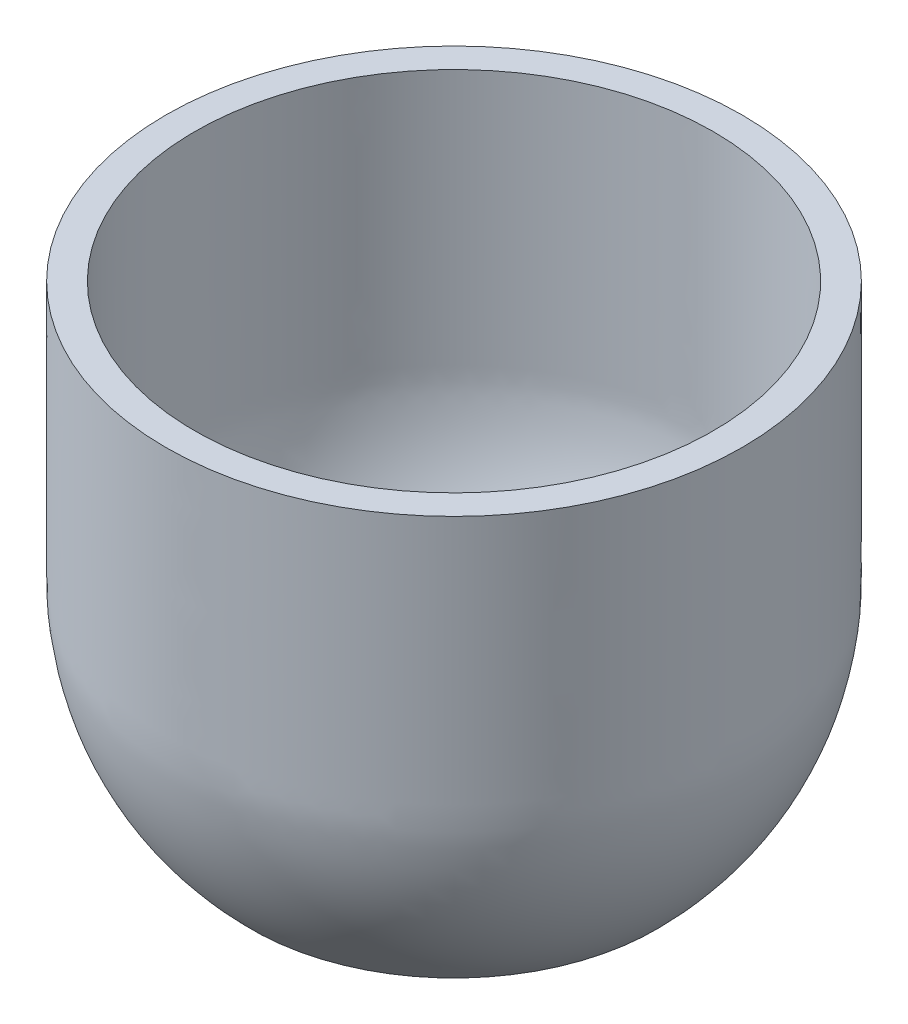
ISO-10303-21;
HEADER;
FILE_DESCRIPTION(('STEP AP214'),'2;1');
FILE_NAME('part.step','',(''),(''),'','','');
FILE_SCHEMA(('AUTOMOTIVE_DESIGN { 1 0 10303 214 1 1 1 1 }'));
ENDSEC;
DATA;
#1=APPLICATION_CONTEXT('core data for automotive mechanical design processes');
#2=APPLICATION_PROTOCOL_DEFINITION('international standard','automotive_design',2000,#1);
#3=PRODUCT_CONTEXT('',#1,'mechanical');
#4=PRODUCT('Part','Part','',(#3));
#5=PRODUCT_RELATED_PRODUCT_CATEGORY('part','',(#4));
#6=PRODUCT_DEFINITION_FORMATION('','',#4);
#7=PRODUCT_DEFINITION_CONTEXT('part definition',#1,'design');
#8=PRODUCT_DEFINITION('design','',#6,#7);
#9=PRODUCT_DEFINITION_SHAPE('','',#8);
#10=(LENGTH_UNIT() NAMED_UNIT(*) SI_UNIT(.MILLI.,.METRE.));
#11=(NAMED_UNIT(*) PLANE_ANGLE_UNIT() SI_UNIT($,.RADIAN.));
#12=(NAMED_UNIT(*) SI_UNIT($,.STERADIAN.) SOLID_ANGLE_UNIT());
#13=UNCERTAINTY_MEASURE_WITH_UNIT(LENGTH_MEASURE(1.E-05),#10,'distance_accuracy_value','');
#14=(GEOMETRIC_REPRESENTATION_CONTEXT(3) GLOBAL_UNCERTAINTY_ASSIGNED_CONTEXT((#13)) GLOBAL_UNIT_ASSIGNED_CONTEXT((#10,
#11,#12)) REPRESENTATION_CONTEXT('',''));
#15=CARTESIAN_POINT('',(0.,0.,0.));
#16=DIRECTION('',(0.,0.,1.));
#17=DIRECTION('',(1.,0.,0.));
#18=AXIS2_PLACEMENT_3D('',#15,#16,#17);
#19=CARTESIAN_POINT('',(0.,5.00000000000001,0.));
#20=DIRECTION('',(0.,1.,0.));
#21=DIRECTION('',(0.,0.,1.));
#22=AXIS2_PLACEMENT_3D('',#19,#20,#21);
#23=PLANE('',#22);
#24=CARTESIAN_POINT('',(0.,5.00000000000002,0.));
#25=DIRECTION('',(0.,-1.,0.));
#26=DIRECTION('',(0.,0.,-1.));
#27=AXIS2_PLACEMENT_3D('',#24,#25,#26);
#28=CIRCLE('',#27,32.8948540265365);
#29=CARTESIAN_POINT('',(0.,5.00000000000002,-32.8948540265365));
#30=VERTEX_POINT('',#29);
#31=EDGE_CURVE('E44',#30,#30,#28,.T.);
#32=ORIENTED_EDGE('',*,*,#31,.F.);
#33=EDGE_LOOP('',(#32));
#34=FACE_BOUND('',#33,.T.);
#35=ADVANCED_FACE('F30',(#34),#23,.T.);
#36=CARTESIAN_POINT('',(0.,0.,0.));
#37=DIRECTION('',(0.,1.,0.));
#38=DIRECTION('',(0.,0.,1.));
#39=AXIS2_PLACEMENT_3D('',#36,#37,#38);
#40=PLANE('',#39);
#41=CARTESIAN_POINT('',(0.,0.,0.));
#42=DIRECTION('',(0.,-1.,0.));
#43=DIRECTION('',(0.,0.,-1.));
#44=AXIS2_PLACEMENT_3D('',#41,#42,#43);
#45=CIRCLE('',#44,35.);
#46=CARTESIAN_POINT('',(0.,0.,-35.));
#47=VERTEX_POINT('',#46);
#48=EDGE_CURVE('E10',#47,#47,#45,.T.);
#49=ORIENTED_EDGE('',*,*,#48,.T.);
#50=EDGE_LOOP('',(#49));
#51=FACE_BOUND('',#50,.T.);
#52=ADVANCED_FACE('F70',(#51),#40,.F.);
#53=CARTESIAN_POINT('',(50.,80.,0.));
#54=CARTESIAN_POINT('',(50.,68.9267855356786,0.));
#55=CARTESIAN_POINT('',(50.,57.8535710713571,0.));
#56=CARTESIAN_POINT('',(50.,46.7803566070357,0.));
#57=CARTESIAN_POINT('',(50.,45.5499994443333,0.));
#58=CARTESIAN_POINT('',(50.,43.0892851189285,0.));
#59=CARTESIAN_POINT('',(50.,39.3982136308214,0.));
#60=CARTESIAN_POINT('',(50.,36.9374993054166,0.));
#61=CARTESIAN_POINT('',(50.,35.7071421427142,0.));
#62=CARTESIAN_POINT('',(50.,34.60424072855,0.));
#63=CARTESIAN_POINT('',(50.,32.3984379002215,0.));
#64=CARTESIAN_POINT('',(49.5967850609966,29.0879720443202,0.));
#65=CARTESIAN_POINT('',(49.2325920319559,26.9112184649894,0.));
#66=CARTESIAN_POINT('',(49.014722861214,25.8300503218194,0.));
#67=CARTESIAN_POINT('',(47.0209702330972,15.9361226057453,0.));
#68=CARTESIAN_POINT('',(42.207709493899,7.06496843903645,0.));
#69=CARTESIAN_POINT('',(35.,0.,0.));
#70=(BOUNDED_CURVE() B_SPLINE_CURVE(3,(#53,#54,#55,#56,#57,#58,#59,#60,#61,#62,#63,#64,#65,#66,
#67,#68,#69),.UNSPECIFIED.,.F.,.F.) B_SPLINE_CURVE_WITH_KNOTS((4,3,1,1,3,1,1,3,4),(0.,
0.397335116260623,0.441483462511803,0.485631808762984,0.529780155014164,0.569355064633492,
0.608929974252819,0.648504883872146,1.),
.UNSPECIFIED.) CURVE() GEOMETRIC_REPRESENTATION_ITEM() RATIONAL_B_SPLINE_CURVE((1.,1.,1.,1.,1.,
1.,1.,1.,1.,1.,1.,1.,1.,1.,0.970563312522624,0.970563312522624,1.)) REPRESENTATION_ITEM(''));
#71=CARTESIAN_POINT('',(0.,0.,0.));
#72=DIRECTION('',(0.,-1.,0.));
#73=AXIS1_PLACEMENT('',#71,#72);
#74=SURFACE_OF_REVOLUTION('',#70,#73);
#75=ORIENTED_EDGE('',*,*,#48,.F.);
#76=EDGE_LOOP('',(#75));
#77=FACE_BOUND('',#76,.T.);
#78=CARTESIAN_POINT('',(0.,80.,0.));
#79=DIRECTION('',(0.,-1.,0.));
#80=DIRECTION('',(0.,0.,-1.));
#81=AXIS2_PLACEMENT_3D('',#78,#79,#80);
#82=CIRCLE('',#81,50.);
#83=CARTESIAN_POINT('',(0.,80.,-50.));
#84=VERTEX_POINT('',#83);
#85=EDGE_CURVE('E36',#84,#84,#82,.T.);
#86=ORIENTED_EDGE('',*,*,#85,.T.);
#87=EDGE_LOOP('',(#86));
#88=FACE_BOUND('',#87,.T.);
#89=ADVANCED_FACE('F67',(#77,#88),#74,.T.);
#90=CARTESIAN_POINT('',(45.,80.,0.));
#91=DIRECTION('',(0.,-1.,0.));
#92=DIRECTION('',(0.,0.,-1.));
#93=AXIS2_PLACEMENT_3D('',#90,#91,#92);
#94=PLANE('',#93);
#95=ORIENTED_EDGE('',*,*,#85,.F.);
#96=EDGE_LOOP('',(#95));
#97=FACE_BOUND('',#96,.T.);
#98=CARTESIAN_POINT('',(0.,80.,0.));
#99=DIRECTION('',(0.,-1.,0.));
#100=DIRECTION('',(0.,0.,-1.));
#101=AXIS2_PLACEMENT_3D('',#98,#99,#100);
#102=CIRCLE('',#101,45.);
#103=CARTESIAN_POINT('',(0.,80.,-45.));
#104=VERTEX_POINT('',#103);
#105=EDGE_CURVE('E40',#104,#104,#102,.T.);
#106=ORIENTED_EDGE('',*,*,#105,.T.);
#107=EDGE_LOOP('',(#106));
#108=FACE_BOUND('',#107,.T.);
#109=ADVANCED_FACE('F63',(#97,#108),#94,.F.);
#110=CARTESIAN_POINT('',(45.,80.,0.));
#111=CARTESIAN_POINT('',(45.,66.4343462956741,0.));
#112=CARTESIAN_POINT('',(45.,52.0208392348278,0.));
#113=CARTESIAN_POINT('',(45.,37.3953688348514,0.));
#114=CARTESIAN_POINT('',(45.,36.335552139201,0.));
#115=CARTESIAN_POINT('',(45.,35.9116254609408,0.));
#116=CARTESIAN_POINT('',(45.0000366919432,35.6984135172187,0.));
#117=CARTESIAN_POINT('',(44.9998683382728,35.0702894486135,0.));
#118=CARTESIAN_POINT('',(44.9990422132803,34.666544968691,0.));
#119=CARTESIAN_POINT('',(44.9894189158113,33.888993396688,0.));
#120=CARTESIAN_POINT('',(44.9806236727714,33.5152032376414,0.));
#121=CARTESIAN_POINT('',(44.957745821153,32.9766852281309,0.));
#122=CARTESIAN_POINT('',(44.9485949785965,32.8022305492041,0.));
#123=CARTESIAN_POINT('',(44.9262607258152,32.4543849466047,0.));
#124=CARTESIAN_POINT('',(44.9129331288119,32.2779969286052,0.));
#125=CARTESIAN_POINT('',(44.8362638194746,31.3841920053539,0.));
#126=CARTESIAN_POINT('',(44.7424047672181,30.6312764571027,0.));
#127=CARTESIAN_POINT('',(44.5165577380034,29.0613205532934,0.));
#128=CARTESIAN_POINT('',(44.3916695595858,28.288519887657,0.));
#129=CARTESIAN_POINT('',(44.1810624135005,27.1530220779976,0.));
#130=CARTESIAN_POINT('',(44.1071089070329,26.7791571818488,0.));
#131=CARTESIAN_POINT('',(43.949159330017,26.0315354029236,0.));
#132=CARTESIAN_POINT('',(43.8652767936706,25.6580375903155,0.));
#133=CARTESIAN_POINT('',(43.4212728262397,23.793065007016,0.));
#134=CARTESIAN_POINT('',(42.9871781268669,22.3091296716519,0.));
#135=CARTESIAN_POINT('',(41.450932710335,17.918464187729,0.));
#136=CARTESIAN_POINT('',(40.1123557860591,15.073920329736,0.));
#137=CARTESIAN_POINT('',(36.8817386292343,9.73661490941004,0.));
#138=CARTESIAN_POINT('',(34.9905492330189,7.24500175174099,0.));
#139=CARTESIAN_POINT('',(32.8948540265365,5.00000000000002,0.));
#140=B_SPLINE_CURVE_WITH_KNOTS('',3,(#110,#111,#112,#113,#114,#115,#116,#117,#118,#119,#120,
#121,#122,#123,#124,#125,#126,#127,#128,#129,#130,#131,#132,#133,#134,#135,#136,#137,#138,#139),
.UNSPECIFIED.,.F.,.F.,(4,1,1,2,2,2,2,2,2,2,2,2,2,2,2,4),(0.,0.500000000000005,0.531250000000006,
0.539062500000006,0.546875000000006,0.562500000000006,0.578125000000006,0.585937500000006,
0.593750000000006,0.625000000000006,0.656250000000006,0.671875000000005,0.687500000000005,
0.750000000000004,0.875000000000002,1.),.UNSPECIFIED.);
#141=CARTESIAN_POINT('',(0.,0.,0.));
#142=DIRECTION('',(0.,-1.,0.));
#143=AXIS1_PLACEMENT('',#141,#142);
#144=SURFACE_OF_REVOLUTION('',#140,#143);
#145=ORIENTED_EDGE('',*,*,#31,.T.);
#146=EDGE_LOOP('',(#145));
#147=FACE_BOUND('',#146,.T.);
#148=ORIENTED_EDGE('',*,*,#105,.F.);
#149=EDGE_LOOP('',(#148));
#150=FACE_BOUND('',#149,.T.);
#151=ADVANCED_FACE('F60',(#147,#150),#144,.F.);
#152=CLOSED_SHELL('',(#35,#52,#89,#109,#151));
#153=MANIFOLD_SOLID_BREP('B2',#152);
#154=ADVANCED_BREP_SHAPE_REPRESENTATION('',(#18,#153),#14);
#155=SHAPE_DEFINITION_REPRESENTATION(#9,#154);
ENDSEC;
END-ISO-10303-21;
